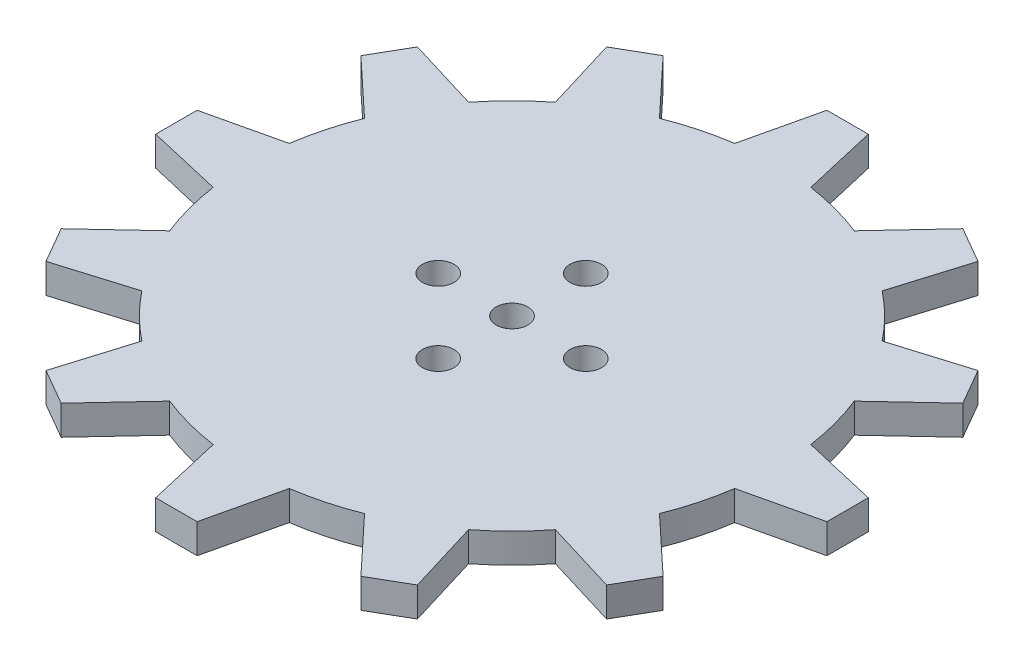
from build123d import *

# Parameters (mm, degrees)
SKETCH2_R           = 25
BOSS_EXTRUDE1_DEPTH = 2.8
BOSS_EXTRUDE4_DEPTH = 2.8
CIRPATTERN1_COUNT   = 12
SKETCH8_R           = 1.5
CUT_EXTRUDE1_DEPTH  = 10


with BuildPart() as part:
    # Sketch2 → Boss-Extrude1 (new body)
    with BuildSketch(Plane(origin=(0, 0, 0), x_dir=(1, 0, 0), z_dir=(0, 1, 0))):
        with Locations(Location((0, 0, 0), (0, 0, 270))):
            Circle(SKETCH2_R)
    boss_extrude1 = extrude(amount=BOSS_EXTRUDE1_DEPTH)

    # Sketch7 → Boss-Extrude4 (add)
    with BuildSketch(Plane(origin=(0, 2.8, 0), x_dir=(1, 0, 0), z_dir=(0, 1, 0))):
        Polygon((-23.06973929, 4), (-23.06973929, -4), (-31.836295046, -1.963458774), (-31.836295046, 1.963458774), align=None)
    boss_extrude4 = extrude(amount=-BOSS_EXTRUDE4_DEPTH)

    # CirPattern1: Boss-Extrude1, Boss-Extrude4 ×12 about axis
    cirpattern1_axis = Axis((0, 0, 0), (0, 1, 0))
    add([boss_extrude1.rotate(cirpattern1_axis, i * 360 / CIRPATTERN1_COUNT) for i in range(1, CIRPATTERN1_COUNT)])
    add([boss_extrude4.rotate(cirpattern1_axis, i * 360 / CIRPATTERN1_COUNT) for i in range(1, CIRPATTERN1_COUNT)])

    # Sketch8 → Cut-Extrude1 (cut)
    with BuildSketch(Plane(origin=(0, 2.8, 0), x_dir=(1, 0, 0), z_dir=(0, 1, 0))):
        with Locations(Location((0, 0, 0), (0, 0, 270))):
            Circle(SKETCH8_R)
        with Locations(Location((-7, 0, 0), (0, 0, 270))):
            Circle(SKETCH8_R)
        with Locations(Location((0, 7, 0), (0, 0, 270))):
            Circle(SKETCH8_R)
        with Locations(Location((7, 0, 0), (0, 0, 270))):
            Circle(SKETCH8_R)
        with Locations(Location((0, -7, 0), (0, 0, 270))):
            Circle(SKETCH8_R)
    extrude(amount=-CUT_EXTRUDE1_DEPTH, mode=Mode.SUBTRACT)


solid = part.part
